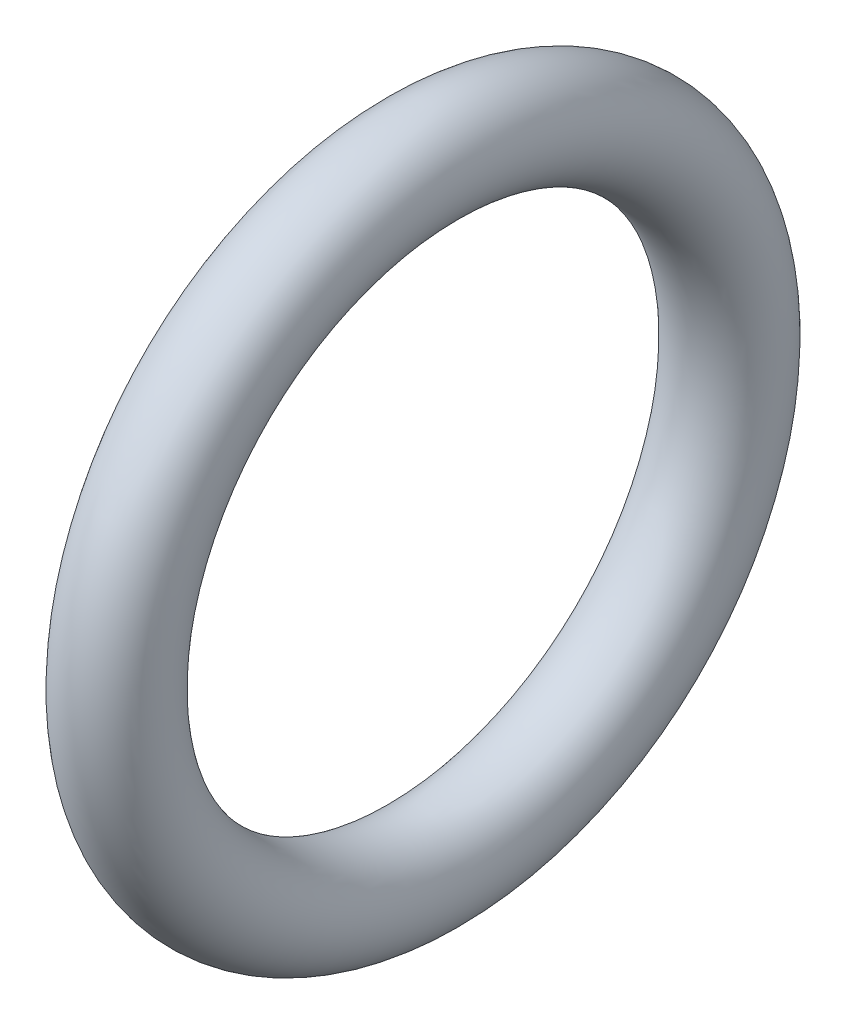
ISO-10303-21;
HEADER;
FILE_DESCRIPTION(('STEP AP214'),'2;1');
FILE_NAME('part.step','',(''),(''),'','','');
FILE_SCHEMA(('AUTOMOTIVE_DESIGN { 1 0 10303 214 1 1 1 1 }'));
ENDSEC;
DATA;
#1=APPLICATION_CONTEXT('core data for automotive mechanical design processes');
#2=APPLICATION_PROTOCOL_DEFINITION('international standard','automotive_design',2000,#1);
#3=PRODUCT_CONTEXT('',#1,'mechanical');
#4=PRODUCT('Part','Part','',(#3));
#5=PRODUCT_RELATED_PRODUCT_CATEGORY('part','',(#4));
#6=PRODUCT_DEFINITION_FORMATION('','',#4);
#7=PRODUCT_DEFINITION_CONTEXT('part definition',#1,'design');
#8=PRODUCT_DEFINITION('design','',#6,#7);
#9=PRODUCT_DEFINITION_SHAPE('','',#8);
#10=(LENGTH_UNIT() NAMED_UNIT(*) SI_UNIT(.MILLI.,.METRE.));
#11=(NAMED_UNIT(*) PLANE_ANGLE_UNIT() SI_UNIT($,.RADIAN.));
#12=(NAMED_UNIT(*) SI_UNIT($,.STERADIAN.) SOLID_ANGLE_UNIT());
#13=UNCERTAINTY_MEASURE_WITH_UNIT(LENGTH_MEASURE(1.E-05),#10,'distance_accuracy_value','');
#14=(GEOMETRIC_REPRESENTATION_CONTEXT(3) GLOBAL_UNCERTAINTY_ASSIGNED_CONTEXT((#13)) GLOBAL_UNIT_ASSIGNED_CONTEXT((#10,
#11,#12)) REPRESENTATION_CONTEXT('',''));
#15=CARTESIAN_POINT('',(0.,0.,0.));
#16=DIRECTION('',(0.,0.,1.));
#17=DIRECTION('',(1.,0.,0.));
#18=AXIS2_PLACEMENT_3D('',#15,#16,#17);
#19=CARTESIAN_POINT('',(7.,0.,0.));
#20=DIRECTION('',(1.,0.,0.));
#21=DIRECTION('',(0.,-1.,0.));
#22=AXIS2_PLACEMENT_3D('',#19,#20,#21);
#23=TOROIDAL_SURFACE('',#22,24.25,3.95);
#24=CARTESIAN_POINT('',(7.,-28.2,0.));
#25=VERTEX_POINT('',#24);
#26=VERTEX_LOOP('',#25);
#27=FACE_BOUND('',#26,.T.);
#28=ADVANCED_FACE('F12',(#27),#23,.T.);
#29=CLOSED_SHELL('',(#28));
#30=MANIFOLD_SOLID_BREP('B1',#29);
#31=ADVANCED_BREP_SHAPE_REPRESENTATION('',(#18,#30),#14);
#32=SHAPE_DEFINITION_REPRESENTATION(#9,#31);
ENDSEC;
END-ISO-10303-21;
